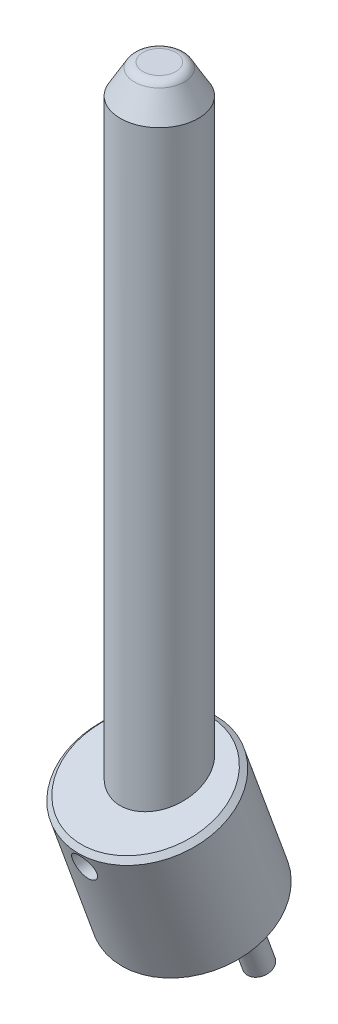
ISO-10303-21;
HEADER;
FILE_DESCRIPTION(('STEP AP214'),'2;1');
FILE_NAME('part.step','',(''),(''),'','','');
FILE_SCHEMA(('AUTOMOTIVE_DESIGN { 1 0 10303 214 1 1 1 1 }'));
ENDSEC;
DATA;
#1=APPLICATION_CONTEXT('core data for automotive mechanical design processes');
#2=APPLICATION_PROTOCOL_DEFINITION('international standard','automotive_design',2000,#1);
#3=PRODUCT_CONTEXT('',#1,'mechanical');
#4=PRODUCT('Part','Part','',(#3));
#5=PRODUCT_RELATED_PRODUCT_CATEGORY('part','',(#4));
#6=PRODUCT_DEFINITION_FORMATION('','',#4);
#7=PRODUCT_DEFINITION_CONTEXT('part definition',#1,'design');
#8=PRODUCT_DEFINITION('design','',#6,#7);
#9=PRODUCT_DEFINITION_SHAPE('','',#8);
#10=(LENGTH_UNIT() NAMED_UNIT(*) SI_UNIT(.MILLI.,.METRE.));
#11=(NAMED_UNIT(*) PLANE_ANGLE_UNIT() SI_UNIT($,.RADIAN.));
#12=(NAMED_UNIT(*) SI_UNIT($,.STERADIAN.) SOLID_ANGLE_UNIT());
#13=UNCERTAINTY_MEASURE_WITH_UNIT(LENGTH_MEASURE(1.E-05),#10,'distance_accuracy_value','');
#14=(GEOMETRIC_REPRESENTATION_CONTEXT(3) GLOBAL_UNCERTAINTY_ASSIGNED_CONTEXT((#13)) GLOBAL_UNIT_ASSIGNED_CONTEXT((#10,
#11,#12)) REPRESENTATION_CONTEXT('',''));
#15=CARTESIAN_POINT('',(0.,0.,0.));
#16=DIRECTION('',(0.,0.,1.));
#17=DIRECTION('',(1.,0.,0.));
#18=AXIS2_PLACEMENT_3D('',#15,#16,#17);
#19=CARTESIAN_POINT('',(0.,149.,0.));
#20=DIRECTION('',(0.,1.,0.));
#21=DIRECTION('',(-1.,0.,0.));
#22=AXIS2_PLACEMENT_3D('',#19,#20,#21);
#23=PLANE('',#22);
#24=CARTESIAN_POINT('',(0.,149.,-3.381197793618));
#25=CARTESIAN_POINT('',(0.0491775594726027,149.,-3.38119852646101));
#26=CARTESIAN_POINT('',(0.0983550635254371,149.,-3.3801249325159));
#27=CARTESIAN_POINT('',(0.19661648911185,149.,-3.37583435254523));
#28=CARTESIAN_POINT('',(0.245700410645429,149.,-3.37261736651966));
#29=CARTESIAN_POINT('',(0.343681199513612,149.,-3.36404526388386));
#30=CARTESIAN_POINT('',(0.392578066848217,149.,-3.35869014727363));
#31=CARTESIAN_POINT('',(0.490091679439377,149.,-3.34585220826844));
#32=CARTESIAN_POINT('',(0.538708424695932,149.,-3.33836938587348));
#33=CARTESIAN_POINT('',(0.635569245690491,149.,-3.32129021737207));
#34=CARTESIAN_POINT('',(0.683813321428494,149.,-3.31169387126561));
#35=CARTESIAN_POINT('',(0.779836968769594,149.,-3.29040593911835));
#36=CARTESIAN_POINT('',(0.827616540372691,149.,-3.27871435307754));
#37=CARTESIAN_POINT('',(0.922620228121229,149.,-3.25325819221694));
#38=CARTESIAN_POINT('',(0.969844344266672,149.,-3.23949361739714));
#39=CARTESIAN_POINT('',(1.0636472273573,149.,-3.20991768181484));
#40=CARTESIAN_POINT('',(1.11022599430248,149.,-3.19410632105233));
#41=CARTESIAN_POINT('',(1.20264951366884,149.,-3.16046691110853));
#42=CARTESIAN_POINT('',(1.24849426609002,149.,-3.14263886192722));
#43=CARTESIAN_POINT('',(1.33936248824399,149.,-3.10500001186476));
#44=CARTESIAN_POINT('',(1.38438595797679,149.,-3.08518921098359));
#45=CARTESIAN_POINT('',(1.47352591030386,149.,-3.04362256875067));
#46=CARTESIAN_POINT('',(1.51764239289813,149.,-3.02186672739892));
#47=CARTESIAN_POINT('',(1.60488439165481,149.,-2.97645141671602));
#48=CARTESIAN_POINT('',(1.64800990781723,149.,-2.95279194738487));
#49=CARTESIAN_POINT('',(1.73318788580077,149.,-2.90361442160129));
#50=CARTESIAN_POINT('',(1.7752403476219,149.,-2.87809636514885));
#51=CARTESIAN_POINT('',(1.85819215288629,149.,-2.82525022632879));
#52=CARTESIAN_POINT('',(1.89909149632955,149.,-2.79792214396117));
#53=CARTESIAN_POINT('',(1.97965926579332,149.,-2.74150802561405));
#54=CARTESIAN_POINT('',(2.01932769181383,149.,-2.71242198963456));
#55=CARTESIAN_POINT('',(2.09735790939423,148.999999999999,-2.65254713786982));
#56=CARTESIAN_POINT('',(2.13571970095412,148.999999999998,-2.62175832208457));
#57=CARTESIAN_POINT('',(2.21106439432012,149.000000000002,-2.55853723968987));
#58=CARTESIAN_POINT('',(2.24804729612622,149.000000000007,-2.52610497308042));
#59=CARTESIAN_POINT('',(2.32056094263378,148.999999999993,-2.45965603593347));
#60=CARTESIAN_POINT('',(2.35609168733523,148.999999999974,-2.42563936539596));
#61=CARTESIAN_POINT('',(2.42705213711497,149.000000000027,-2.35468855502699));
#62=CARTESIAN_POINT('',(2.46241950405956,149.000000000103,-2.3176920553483));
#63=CARTESIAN_POINT('',(2.53146011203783,148.999999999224,-2.24214947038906));
#64=CARTESIAN_POINT('',(2.56513331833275,148.999999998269,-2.20360335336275));
#65=CARTESIAN_POINT('',(2.63071590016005,148.99999999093,-2.12503640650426));
#66=CARTESIAN_POINT('',(2.66262520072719,148.999999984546,-2.08501551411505));
#67=CARTESIAN_POINT('',(2.72461562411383,148.999999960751,-2.00357584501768));
#68=CARTESIAN_POINT('',(2.75469662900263,148.999999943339,-1.96215697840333));
#69=CARTESIAN_POINT('',(2.79840512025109,148.999999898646,-1.89905244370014));
#70=CARTESIAN_POINT('',(2.81273996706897,148.999999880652,-1.87785353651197));
#71=CARTESIAN_POINT('',(2.84090934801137,148.999999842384,-1.83514783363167));
#72=CARTESIAN_POINT('',(2.85474423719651,148.999999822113,-1.81364127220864));
#73=CARTESIAN_POINT('',(2.89548728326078,148.999999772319,-1.74864244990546));
#74=CARTESIAN_POINT('',(2.92163476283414,148.999999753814,-1.70466969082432));
#75=CARTESIAN_POINT('',(2.97183520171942,148.999999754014,-1.6155484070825));
#76=CARTESIAN_POINT('',(2.99588817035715,148.99999977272,-1.57039988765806));
#77=CARTESIAN_POINT('',(3.04188859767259,148.999999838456,-1.47904330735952));
#78=CARTESIAN_POINT('',(3.06383619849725,148.999999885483,-1.43283531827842));
#79=CARTESIAN_POINT('',(3.10541271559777,148.999999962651,-1.33939702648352));
#80=CARTESIAN_POINT('',(3.12504193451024,148.999999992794,-1.29216685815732));
#81=CARTESIAN_POINT('',(3.15291976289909,149.000000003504,-1.22146858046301));
#82=CARTESIAN_POINT('',(3.16183489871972,149.000000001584,-1.19825675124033));
#83=CARTESIAN_POINT('',(3.1990199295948,148.999999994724,-1.09818755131));
#84=CARTESIAN_POINT('',(3.22479363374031,148.999999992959,-1.02037068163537));
#85=CARTESIAN_POINT('',(3.25883872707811,148.999999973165,-0.903503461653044));
#86=CARTESIAN_POINT('',(3.26930037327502,148.999999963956,-0.865070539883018));
#87=CARTESIAN_POINT('',(3.29035807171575,148.999999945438,-0.78187482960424));
#88=CARTESIAN_POINT('',(3.30072437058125,148.999999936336,-0.737052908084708));
#89=CARTESIAN_POINT('',(3.3142455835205,148.999999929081,-0.672514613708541));
#90=CARTESIAN_POINT('',(3.31816009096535,148.999999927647,-0.652953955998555));
#91=CARTESIAN_POINT('',(3.32632060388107,148.999999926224,-0.610180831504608));
#92=CARTESIAN_POINT('',(3.33049625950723,148.999999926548,-0.586954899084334));
#93=CARTESIAN_POINT('',(3.34228609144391,148.999999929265,-0.517153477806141));
#94=CARTESIAN_POINT('',(3.34916374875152,148.999999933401,-0.47045146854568));
#95=CARTESIAN_POINT('',(3.36093725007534,148.999999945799,-0.376800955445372));
#96=CARTESIAN_POINT('',(3.36583314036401,148.999999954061,-0.329852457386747));
#97=CARTESIAN_POINT('',(3.37363894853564,148.999999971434,-0.235792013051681));
#98=CARTESIAN_POINT('',(3.37654894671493,148.999999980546,-0.188680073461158));
#99=CARTESIAN_POINT('',(3.38036477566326,148.999999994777,-0.0943781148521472));
#100=CARTESIAN_POINT('',(3.38127072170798,148.999999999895,-0.0471881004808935));
#101=CARTESIAN_POINT('',(3.38112480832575,149.000000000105,0.0472251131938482));
#102=CARTESIAN_POINT('',(3.38007141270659,148.999999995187,0.0944483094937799));
#103=CARTESIAN_POINT('',(3.37605062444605,148.999999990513,0.188811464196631));
#104=CARTESIAN_POINT('',(3.37308328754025,148.999999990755,0.235951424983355));
#105=CARTESIAN_POINT('',(3.36523468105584,148.99999999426,0.330073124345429));
#106=CARTESIAN_POINT('',(3.36035337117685,148.999999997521,0.37705485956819));
#107=CARTESIAN_POINT('',(3.34865879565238,149.000000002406,0.470780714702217));
#108=CARTESIAN_POINT('',(3.34184539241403,149.000000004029,0.517524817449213));
#109=CARTESIAN_POINT('',(3.33026552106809,148.999999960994,0.587415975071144));
#110=CARTESIAN_POINT('',(3.32617861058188,148.999999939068,0.610677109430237));
#111=CARTESIAN_POINT('',(3.32001382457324,148.999999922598,0.64332853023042));
#112=CARTESIAN_POINT('',(3.31818160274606,148.999999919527,0.652765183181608));
#113=CARTESIAN_POINT('',(3.30790809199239,148.999999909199,0.70438704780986));
#114=CARTESIAN_POINT('',(3.29862776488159,148.999999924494,0.746407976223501));
#115=CARTESIAN_POINT('',(3.27611885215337,148.999999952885,0.839847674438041));
#116=CARTESIAN_POINT('',(3.26247449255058,148.999999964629,0.89116555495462));
#117=CARTESIAN_POINT('',(3.22698341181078,148.999999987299,1.01297067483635));
#118=CARTESIAN_POINT('',(3.20401223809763,148.999999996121,1.08313569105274));
#119=CARTESIAN_POINT('',(3.16757439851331,149.00000000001,1.18334600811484));
#120=CARTESIAN_POINT('',(3.15590282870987,148.999999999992,1.21405838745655));
#121=CARTESIAN_POINT('',(3.12494638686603,149.000000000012,1.29216796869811));
#122=CARTESIAN_POINT('',(3.10504412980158,149.000000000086,1.33932319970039));
#123=CARTESIAN_POINT('',(3.06313614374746,148.999999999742,1.43268851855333));
#124=CARTESIAN_POINT('',(3.04113038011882,148.999999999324,1.4788985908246));
#125=CARTESIAN_POINT('',(2.99507134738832,148.999999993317,1.57028914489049));
#126=CARTESIAN_POINT('',(2.97101799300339,148.999999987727,1.61546958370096));
#127=CARTESIAN_POINT('',(2.92090425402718,148.99999996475,1.70470923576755));
#128=CARTESIAN_POINT('',(2.89484373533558,148.999999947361,1.74876837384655));
#129=CARTESIAN_POINT('',(2.85429856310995,148.9999999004,1.81395013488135));
#130=CARTESIAN_POINT('',(2.84054017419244,148.999999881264,1.83552759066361));
#131=CARTESIAN_POINT('',(2.81254197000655,148.999999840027,1.87834577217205));
#132=CARTESIAN_POINT('',(2.79830250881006,148.999999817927,1.89958672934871));
#133=CARTESIAN_POINT('',(2.75484041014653,148.999999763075,1.96280026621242));
#134=CARTESIAN_POINT('',(2.72487327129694,148.999999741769,2.00426477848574));
#135=CARTESIAN_POINT('',(2.66302492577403,148.999999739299,2.08573639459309));
#136=CARTESIAN_POINT('',(2.63114372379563,148.999999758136,2.12574350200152));
#137=CARTESIAN_POINT('',(2.56557045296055,148.999999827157,2.20424439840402));
#138=CARTESIAN_POINT('',(2.5318785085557,148.99999987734,2.24273829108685));
#139=CARTESIAN_POINT('',(2.46263073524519,148.999999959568,2.31799882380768));
#140=CARTESIAN_POINT('',(2.42707515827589,148.999999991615,2.35476569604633));
#141=CARTESIAN_POINT('',(2.37140677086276,149.000000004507,2.41027252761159));
#142=CARTESIAN_POINT('',(2.35175738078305,149.000000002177,2.42948514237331));
#143=CARTESIAN_POINT('',(2.26802085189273,148.999999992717,2.50941121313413));
#144=CARTESIAN_POINT('',(2.20177871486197,148.999999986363,2.56792039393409));
#145=CARTESIAN_POINT('',(2.10003781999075,148.999999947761,2.65091291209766));
#146=CARTESIAN_POINT('',(2.06619123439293,148.999999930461,2.67746023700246));
#147=CARTESIAN_POINT('',(1.99205588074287,148.999999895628,2.73332764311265));
#148=CARTESIAN_POINT('',(1.95159524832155,148.999999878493,2.76242170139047));
#149=CARTESIAN_POINT('',(1.89261855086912,148.99999986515,2.80284358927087));
#150=CARTESIAN_POINT('',(1.87461412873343,148.999999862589,2.81492542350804));
#151=CARTESIAN_POINT('',(1.83512217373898,148.99999986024,2.84086885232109));
#152=CARTESIAN_POINT('',(1.813589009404,148.999999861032,2.85466108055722));
#153=CARTESIAN_POINT('',(1.74852510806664,148.999999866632,2.89529179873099));
#154=CARTESIAN_POINT('',(1.70452676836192,148.999999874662,2.921386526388));
#155=CARTESIAN_POINT('',(1.61538182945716,148.999999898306,2.97152713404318));
#156=CARTESIAN_POINT('',(1.57023526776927,148.999999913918,2.9955730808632));
#157=CARTESIAN_POINT('',(1.47889045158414,148.999999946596,3.04157160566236));
#158=CARTESIAN_POINT('',(1.43269225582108,148.99999996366,3.06352430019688));
#159=CARTESIAN_POINT('',(1.33933610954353,148.99999999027,3.10527343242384));
#160=CARTESIAN_POINT('',(1.29217823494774,148.999999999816,3.12507003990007));
#161=CARTESIAN_POINT('',(1.20065831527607,149.00000000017,3.16109558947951));
#162=CARTESIAN_POINT('',(1.15635789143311,148.999999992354,3.17748154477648));
#163=CARTESIAN_POINT('',(1.06713504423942,148.999999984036,3.20845589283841));
#164=CARTESIAN_POINT('',(1.02221264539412,148.999999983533,3.22304435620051));
#165=CARTESIAN_POINT('',(0.931813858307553,148.999999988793,3.25039463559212));
#166=CARTESIAN_POINT('',(0.886337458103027,148.999999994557,3.26315641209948));
#167=CARTESIAN_POINT('',(0.79489519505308,149.000000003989,3.28680491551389));
#168=CARTESIAN_POINT('',(0.748929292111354,149.000000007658,3.29769148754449));
#169=CARTESIAN_POINT('',(0.686121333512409,148.999999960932,3.31129818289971));
#170=CARTESIAN_POINT('',(0.6694438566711,148.999999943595,3.31479031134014));
#171=CARTESIAN_POINT('',(0.639370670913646,148.999999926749,3.32077891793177));
#172=CARTESIAN_POINT('',(0.625986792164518,148.999999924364,3.32333471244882));
#173=CARTESIAN_POINT('',(0.564781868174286,148.999999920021,3.33461824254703));
#174=CARTESIAN_POINT('',(0.516772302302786,148.999999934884,3.34234416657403));
#175=CARTESIAN_POINT('',(0.428809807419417,148.999999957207,3.35455837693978));
#176=CARTESIAN_POINT('',(0.388901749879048,148.999999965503,3.35937566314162));
#177=CARTESIAN_POINT('',(0.315880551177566,148.999999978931,3.36686744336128));
#178=CARTESIAN_POINT('',(0.282790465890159,148.999999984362,3.3697687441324));
#179=CARTESIAN_POINT('',(0.198641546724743,148.999999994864,3.37590122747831));
#180=CARTESIAN_POINT('',(0.147531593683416,148.999999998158,3.3784640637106));
#181=CARTESIAN_POINT('',(0.0775593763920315,148.999999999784,3.38039422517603));
#182=CARTESIAN_POINT('',(0.0587195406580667,148.999999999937,3.38075747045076));
#183=CARTESIAN_POINT('',(0.0265859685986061,149.000000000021,3.38112029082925));
#184=CARTESIAN_POINT('',(0.0132930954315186,149.000000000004,3.38119546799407));
#185=CARTESIAN_POINT('',(0.,149.,3.381197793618));
#186=B_SPLINE_CURVE_WITH_KNOTS('',3,(#24,#25,#26,#27,#28,#29,#30,#31,#32,#33,#34,#35,#36,#37,
#38,#39,#40,#41,#42,#43,#44,#45,#46,#47,#48,#49,#50,#51,#52,#53,#54,#55,#56,#57,#58,#59,#60,#61,
#62,#63,#64,#65,#66,#67,#68,#69,#70,#71,#72,#73,#74,#75,#76,#77,#78,#79,#80,#81,#82,#83,#84,#85,
#86,#87,#88,#89,#90,#91,#92,#93,#94,#95,#96,#97,#98,#99,#100,#101,#102,#103,#104,#105,#106,#107,
#108,#109,#110,#111,#112,#113,#114,#115,#116,#117,#118,#119,#120,#121,#122,#123,#124,#125,#126,
#127,#128,#129,#130,#131,#132,#133,#134,#135,#136,#137,#138,#139,#140,#141,#142,#143,#144,#145,
#146,#147,#148,#149,#150,#151,#152,#153,#154,#155,#156,#157,#158,#159,#160,#161,#162,#163,#164,
#165,#166,#167,#168,#169,#170,#171,#172,#173,#174,#175,#176,#177,#178,#179,#180,#181,#182,#183,
#184,#185),.UNSPECIFIED.,.F.,.F.,(4,2,2,2,2,2,2,2,2,2,2,2,2,2,2,2,2,2,2,2,2,2,2,2,2,2,2,2,2,2,2,
2,2,2,2,2,2,2,2,2,2,2,2,2,2,2,2,2,2,2,2,2,2,2,2,2,2,2,2,2,2,2,2,2,2,2,2,2,2,2,2,2,2,2,2,2,2,2,2,
2,4),(0.,0.147520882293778,0.295041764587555,0.44256264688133,0.590083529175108,
0.737604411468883,0.88512529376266,1.03264617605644,1.18016705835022,1.32768794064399,
1.47520882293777,1.62272970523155,1.77025058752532,1.9177714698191,2.06529235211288,
2.21281323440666,2.36033411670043,2.50785499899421,2.65537588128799,2.8088697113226,
2.96236668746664,3.11587018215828,3.26938356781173,3.34614986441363,3.42286052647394,
3.57627688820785,3.72969256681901,3.88309788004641,4.03648314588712,4.11107818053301,
4.3567273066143,4.47620511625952,4.61417295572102,4.67401611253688,4.74480627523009,
4.88637772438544,5.02794586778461,5.16950828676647,5.31106256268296,5.45272786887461,
5.59438904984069,5.73605321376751,5.87772746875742,5.94857427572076,5.97741258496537,
6.10647459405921,6.26572562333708,6.48702971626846,6.58558753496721,6.73908100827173,
6.89257700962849,7.04607940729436,7.19959206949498,7.27635828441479,7.35306917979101,
7.50648650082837,7.65990344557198,7.81330985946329,7.9666955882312,8.0491391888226,
8.31394403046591,8.44297054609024,8.59241517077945,8.65745956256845,8.73416806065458,
8.88757342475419,9.04097378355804,9.19436559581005,9.34774532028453,9.48940808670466,
9.63106528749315,9.77272555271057,9.91439751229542,9.96551300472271,10.0063890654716,
10.1522163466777,10.2727850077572,10.3724238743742,10.5258841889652,10.5824125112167,
10.6222911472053),.UNSPECIFIED.);
#187=CARTESIAN_POINT('',(0.,149.,-3.3811977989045));
#188=VERTEX_POINT('',#187);
#189=CARTESIAN_POINT('',(0.,149.,3.3811977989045));
#190=VERTEX_POINT('',#189);
#191=EDGE_CURVE('P0_E38',#188,#190,#186,.T.);
#192=ORIENTED_EDGE('',*,*,#191,.F.);
#193=CARTESIAN_POINT('',(0.,149.,0.));
#194=DIRECTION('',(0.,-1.,0.));
#195=DIRECTION('',(0.,0.,1.));
#196=AXIS2_PLACEMENT_3D('',#193,#194,#195);
#197=CIRCLE('',#196,3.381197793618);
#198=EDGE_CURVE('P0_E42',#190,#188,#197,.T.);
#199=ORIENTED_EDGE('',*,*,#198,.F.);
#200=EDGE_LOOP('',(#192,#199));
#201=FACE_BOUND('',#200,.T.);
#202=ADVANCED_FACE('P0_F17',(#201),#23,.T.);
#203=CARTESIAN_POINT('',(0.,147.,0.));
#204=DIRECTION('',(0.,1.,0.));
#205=DIRECTION('',(0.0117940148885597,0.,0.999930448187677));
#206=AXIS2_PLACEMENT_3D('',#203,#204,#205);
#207=TOROIDAL_SURFACE('',#206,3.381197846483,2.);
#208=ORIENTED_EDGE('',*,*,#191,.T.);
#209=ORIENTED_EDGE('',*,*,#198,.T.);
#210=EDGE_LOOP('',(#208,#209));
#211=FACE_BOUND('',#210,.T.);
#212=CARTESIAN_POINT('',(0.,148.000000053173,0.));
#213=DIRECTION('',(0.,-1.,0.));
#214=DIRECTION('',(0.,0.,1.));
#215=AXIS2_PLACEMENT_3D('',#212,#213,#214);
#216=CIRCLE('',#215,5.11324862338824);
#217=CARTESIAN_POINT('',(0.,148.000000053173,5.11324862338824));
#218=VERTEX_POINT('',#217);
#219=EDGE_CURVE('P0_E48',#218,#218,#216,.T.);
#220=ORIENTED_EDGE('',*,*,#219,.F.);
#221=EDGE_LOOP('',(#220));
#222=FACE_BOUND('',#221,.T.);
#223=ADVANCED_FACE('P0_F40',(#211,#222),#207,.T.);
#224=CARTESIAN_POINT('',(0.,0.,0.));
#225=DIRECTION('',(0.,1.,0.));
#226=DIRECTION('',(-1.,0.,0.));
#227=AXIS2_PLACEMENT_3D('',#224,#225,#226);
#228=PLANE('',#227);
#229=CARTESIAN_POINT('',(0.,9.20802746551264E-07,0.));
#230=DIRECTION('',(0.,1.,0.));
#231=DIRECTION('',(-1.,0.,0.));
#232=AXIS2_PLACEMENT_3D('',#229,#230,#231);
#233=CIRCLE('',#232,6.99999849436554);
#234=CARTESIAN_POINT('',(-6.99999849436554,9.20802746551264E-07,0.));
#235=VERTEX_POINT('',#234);
#236=EDGE_CURVE('P0_E85',#235,#235,#233,.T.);
#237=ORIENTED_EDGE('',*,*,#236,.F.);
#238=EDGE_LOOP('',(#237));
#239=FACE_BOUND('',#238,.T.);
#240=ADVANCED_FACE('P0_F76',(#239),#228,.F.);
#241=CARTESIAN_POINT('',(0.,14.,2.94337567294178));
#242=DIRECTION('',(0.,0.,1.));
#243=DIRECTION('',(0.,-1.,0.));
#244=AXIS2_PLACEMENT_3D('',#241,#242,#243);
#245=CONICAL_SURFACE('',#244,2.50000000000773,1.04719755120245);
#246=CARTESIAN_POINT('',(0.,14.0000000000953,1.49999999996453));
#247=VERTEX_POINT('',#246);
#248=VERTEX_LOOP('',#247);
#249=FACE_BOUND('',#248,.T.);
#250=CARTESIAN_POINT('',(0.,14.,2.943375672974));
#251=DIRECTION('',(0.,0.,1.));
#252=DIRECTION('',(0.,-1.,0.));
#253=AXIS2_PLACEMENT_3D('',#250,#251,#252);
#254=CIRCLE('',#253,2.5);
#255=CARTESIAN_POINT('',(0.,11.5,2.943375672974));
#256=VERTEX_POINT('',#255);
#257=EDGE_CURVE('P0_E82',#256,#256,#254,.T.);
#258=ORIENTED_EDGE('',*,*,#257,.T.);
#259=EDGE_LOOP('',(#258));
#260=FACE_BOUND('',#259,.T.);
#261=ADVANCED_FACE('P0_F116',(#249,#260),#245,.F.);
#262=CARTESIAN_POINT('',(0.,143.0000000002,0.));
#263=DIRECTION('',(0.,-1.,0.));
#264=DIRECTION('',(1.,0.,0.));
#265=AXIS2_PLACEMENT_3D('',#262,#263,#264);
#266=CONICAL_SURFACE('',#265,7.99999999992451,0.52359877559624);
#267=CARTESIAN_POINT('',(0.,143.,0.));
#268=DIRECTION('',(0.,1.,0.));
#269=DIRECTION('',(-1.,0.,0.));
#270=AXIS2_PLACEMENT_3D('',#267,#268,#269);
#271=CIRCLE('',#270,8.);
#272=CARTESIAN_POINT('',(-8.,143.,0.));
#273=VERTEX_POINT('',#272);
#274=EDGE_CURVE('P0_E92',#273,#273,#271,.F.);
#275=ORIENTED_EDGE('',*,*,#274,.F.);
#276=EDGE_LOOP('',(#275));
#277=FACE_BOUND('',#276,.T.);
#278=ORIENTED_EDGE('',*,*,#219,.T.);
#279=EDGE_LOOP('',(#278));
#280=FACE_BOUND('',#279,.T.);
#281=ADVANCED_FACE('P0_F108',(#277,#280),#266,.T.);
#282=CARTESIAN_POINT('',(0.,1.00000172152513,0.));
#283=DIRECTION('',(0.,1.,0.));
#284=DIRECTION('',(-1.,0.,0.));
#285=AXIS2_PLACEMENT_3D('',#282,#283,#284);
#286=CONICAL_SURFACE('',#285,7.9999989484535,0.785397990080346);
#287=CARTESIAN_POINT('',(0.,1.000000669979,0.));
#288=DIRECTION('',(0.,1.,0.));
#289=DIRECTION('',(-1.,0.,0.));
#290=AXIS2_PLACEMENT_3D('',#287,#288,#289);
#291=CIRCLE('',#290,8.);
#292=CARTESIAN_POINT('',(-8.,1.000000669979,0.));
#293=VERTEX_POINT('',#292);
#294=EDGE_CURVE('P0_E28',#293,#293,#291,.T.);
#295=ORIENTED_EDGE('',*,*,#294,.F.);
#296=EDGE_LOOP('',(#295));
#297=FACE_BOUND('',#296,.T.);
#298=ORIENTED_EDGE('',*,*,#236,.T.);
#299=EDGE_LOOP('',(#298));
#300=FACE_BOUND('',#299,.T.);
#301=ADVANCED_FACE('P0_F105',(#297,#300),#286,.T.);
#302=CARTESIAN_POINT('',(0.,14.,1.075));
#303=DIRECTION('',(0.,0.,1.));
#304=DIRECTION('',(0.,-1.,0.));
#305=AXIS2_PLACEMENT_3D('',#302,#303,#304);
#306=CYLINDRICAL_SURFACE('',#305,2.5);
#307=ORIENTED_EDGE('',*,*,#257,.F.);
#308=EDGE_LOOP('',(#307));
#309=FACE_BOUND('',#308,.T.);
#310=CARTESIAN_POINT('',(0.,11.5,8.));
#311=CARTESIAN_POINT('',(-0.136696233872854,11.5000075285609,7.99999486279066));
#312=CARTESIAN_POINT('',(-0.273538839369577,11.5112631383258,7.99645812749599));
#313=CARTESIAN_POINT('',(-0.543359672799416,11.5559205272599,7.98267442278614));
#314=CARTESIAN_POINT('',(-0.676330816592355,11.589360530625,7.97241587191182));
#315=CARTESIAN_POINT('',(-0.934271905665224,11.6771461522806,7.94631394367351));
#316=CARTESIAN_POINT('',(-1.05925832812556,11.7314469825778,7.93048253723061));
#317=CARTESIAN_POINT('',(-1.2983071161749,11.8592577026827,7.89487323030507));
#318=CARTESIAN_POINT('',(-1.4123711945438,11.9327645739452,7.87509595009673));
#319=CARTESIAN_POINT('',(-1.62992724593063,12.0993097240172,7.83300483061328));
#320=CARTESIAN_POINT('',(-1.73303436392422,12.1928367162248,7.81063552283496));
#321=CARTESIAN_POINT('',(-1.92239021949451,12.3957308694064,7.76620212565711));
#322=CARTESIAN_POINT('',(-2.00863490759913,12.5051018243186,7.74413811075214));
#323=CARTESIAN_POINT('',(-2.16388692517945,12.7398894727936,7.70222283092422));
#324=CARTESIAN_POINT('',(-2.23241606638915,12.8656356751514,7.6824396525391));
#325=CARTESIAN_POINT('',(-2.34719509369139,13.1275854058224,7.64815595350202));
#326=CARTESIAN_POINT('',(-2.3934509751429,13.2637861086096,7.6336540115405));
#327=CARTESIAN_POINT('',(-2.4609691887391,13.5384561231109,7.61215214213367));
#328=CARTESIAN_POINT('',(-2.48294218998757,13.6767336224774,7.60493946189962));
#329=CARTESIAN_POINT('',(-2.50349110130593,13.9551861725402,7.59820110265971));
#330=CARTESIAN_POINT('',(-2.50207322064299,14.0953607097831,7.59867338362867));
#331=CARTESIAN_POINT('',(-2.47643652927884,14.3677485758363,7.60706377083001));
#332=CARTESIAN_POINT('',(-2.45312128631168,14.5000575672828,7.61468679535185));
#333=CARTESIAN_POINT('',(-2.38581648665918,14.7587836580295,7.63604044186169));
#334=CARTESIAN_POINT('',(-2.34182462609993,14.8852000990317,7.64977174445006));
#335=CARTESIAN_POINT('',(-2.23377596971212,15.1307074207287,7.68202134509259));
#336=CARTESIAN_POINT('',(-2.16943495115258,15.2496640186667,7.7006067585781));
#337=CARTESIAN_POINT('',(-2.02271557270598,15.4753816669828,7.74043834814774));
#338=CARTESIAN_POINT('',(-1.94033355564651,15.5821402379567,7.76168506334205));
#339=CARTESIAN_POINT('',(-1.75545127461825,15.7855312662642,7.80562654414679));
#340=CARTESIAN_POINT('',(-1.65220788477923,15.8814846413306,7.82834327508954));
#341=CARTESIAN_POINT('',(-1.43076939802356,16.0549161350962,7.87182395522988));
#342=CARTESIAN_POINT('',(-1.31256787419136,16.1323862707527,7.8925870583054));
#343=CARTESIAN_POINT('',(-1.06322528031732,16.2671146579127,7.93004255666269));
#344=CARTESIAN_POINT('',(-0.931982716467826,16.3241954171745,7.94669883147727));
#345=CARTESIAN_POINT('',(-0.661263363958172,16.4151681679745,7.97377752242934));
#346=CARTESIAN_POINT('',(-0.521804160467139,16.4491078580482,7.98421275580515));
#347=CARTESIAN_POINT('',(-0.317572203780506,16.4805676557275,7.9939447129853));
#348=CARTESIAN_POINT('',(-0.25430866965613,16.4878463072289,7.99620897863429));
#349=CARTESIAN_POINT('',(-0.127374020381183,16.4975642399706,7.99923782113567));
#350=CARTESIAN_POINT('',(-0.0637029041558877,16.5000035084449,8.000002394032));
#351=CARTESIAN_POINT('',(0.13669623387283,16.4999924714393,7.99999486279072));
#352=CARTESIAN_POINT('',(0.273538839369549,16.4887368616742,7.996458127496));
#353=CARTESIAN_POINT('',(0.543359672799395,16.4440794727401,7.98267442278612));
#354=CARTESIAN_POINT('',(0.676330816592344,16.410639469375,7.97241587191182));
#355=CARTESIAN_POINT('',(0.934271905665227,16.3228538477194,7.94631394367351));
#356=CARTESIAN_POINT('',(1.05925832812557,16.2685530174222,7.93048253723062));
#357=CARTESIAN_POINT('',(1.2983071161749,16.1407422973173,7.89487323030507));
#358=CARTESIAN_POINT('',(1.4123711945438,16.0672354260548,7.87509595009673));
#359=CARTESIAN_POINT('',(1.62992724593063,15.9006902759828,7.83300483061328));
#360=CARTESIAN_POINT('',(1.73303436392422,15.8071632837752,7.81063552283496));
#361=CARTESIAN_POINT('',(1.92239021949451,15.6042691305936,7.76620212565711));
#362=CARTESIAN_POINT('',(2.00863490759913,15.4948981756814,7.74413811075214));
#363=CARTESIAN_POINT('',(2.16388692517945,15.2601105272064,7.70222283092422));
#364=CARTESIAN_POINT('',(2.23241606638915,15.1343643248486,7.6824396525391));
#365=CARTESIAN_POINT('',(2.34719509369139,14.8724145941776,7.64815595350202));
#366=CARTESIAN_POINT('',(2.3934509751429,14.7362138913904,7.6336540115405));
#367=CARTESIAN_POINT('',(2.4609691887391,14.4615438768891,7.61215214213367));
#368=CARTESIAN_POINT('',(2.48294218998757,14.3232663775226,7.60493946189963));
#369=CARTESIAN_POINT('',(2.50349110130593,14.0448138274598,7.59820110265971));
#370=CARTESIAN_POINT('',(2.50207322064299,13.9046392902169,7.59867338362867));
#371=CARTESIAN_POINT('',(2.47643652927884,13.6322514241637,7.60706377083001));
#372=CARTESIAN_POINT('',(2.45312128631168,13.4999424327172,7.61468679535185));
#373=CARTESIAN_POINT('',(2.38581648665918,13.2412163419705,7.63604044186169));
#374=CARTESIAN_POINT('',(2.34182462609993,13.1147999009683,7.64977174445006));
#375=CARTESIAN_POINT('',(2.23377596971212,12.8692925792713,7.68202134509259));
#376=CARTESIAN_POINT('',(2.16943495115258,12.7503359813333,7.7006067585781));
#377=CARTESIAN_POINT('',(2.02271557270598,12.5246183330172,7.74043834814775));
#378=CARTESIAN_POINT('',(1.94033355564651,12.4178597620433,7.76168506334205));
#379=CARTESIAN_POINT('',(1.75545127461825,12.2144687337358,7.80562654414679));
#380=CARTESIAN_POINT('',(1.65220788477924,12.1185153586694,7.82834327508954));
#381=CARTESIAN_POINT('',(1.43076939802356,11.9450838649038,7.87182395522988));
#382=CARTESIAN_POINT('',(1.31256787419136,11.8676137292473,7.8925870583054));
#383=CARTESIAN_POINT('',(1.06322528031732,11.7328853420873,7.93004255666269));
#384=CARTESIAN_POINT('',(0.931982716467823,11.6758045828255,7.94669883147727));
#385=CARTESIAN_POINT('',(0.661263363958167,11.5848318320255,7.97377752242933));
#386=CARTESIAN_POINT('',(0.521804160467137,11.5508921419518,7.98421275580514));
#387=CARTESIAN_POINT('',(0.317572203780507,11.5194323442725,7.9939447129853));
#388=CARTESIAN_POINT('',(0.254308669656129,11.512153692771,7.9962089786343));
#389=CARTESIAN_POINT('',(0.127374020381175,11.5024357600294,7.99923782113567));
#390=CARTESIAN_POINT('',(0.0637029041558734,11.4999964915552,8.00000239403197));
#391=CARTESIAN_POINT('',(0.,11.5,8.));
#392=B_SPLINE_CURVE_WITH_KNOTS('',3,(#310,#311,#312,#313,#314,#315,#316,#317,#318,#319,#320,
#321,#322,#323,#324,#325,#326,#327,#328,#329,#330,#331,#332,#333,#334,#335,#336,#337,#338,#339,
#340,#341,#342,#343,#344,#345,#346,#347,#348,#349,#350,#351,#352,#353,#354,#355,#356,#357,#358,
#359,#360,#361,#362,#363,#364,#365,#366,#367,#368,#369,#370,#371,#372,#373,#374,#375,#376,#377,
#378,#379,#380,#381,#382,#383,#384,#385,#386,#387,#388,#389,#390,#391),.UNSPECIFIED.,.T.,.F.,(4,
2,2,2,2,2,2,2,2,2,2,2,2,2,2,2,2,2,2,2,2,2,2,2,2,2,2,2,2,2,2,2,2,2,2,2,2,2,2,2,4),(0.,
0.409843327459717,0.820394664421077,1.23006943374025,1.6396798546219,2.06074511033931,
2.48191136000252,2.91347666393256,3.34492573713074,3.76338291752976,4.18172901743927,
4.58353732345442,4.98539041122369,5.39312450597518,5.80094133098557,6.22725884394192,
6.65376015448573,7.08388858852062,7.51312773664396,7.70412159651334,7.89511596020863,
8.30495928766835,8.71551062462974,9.12518539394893,9.53479581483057,9.95586107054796,
10.3770273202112,10.8085926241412,11.2400416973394,11.6584988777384,12.0768449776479,
12.4786532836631,12.8805063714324,13.2882404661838,13.6960572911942,14.1223748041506,
14.5488761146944,14.9790045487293,15.4082436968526,15.599237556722,15.7902319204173),.UNSPECIFIED.);
#393=CARTESIAN_POINT('',(0.,11.5,8.));
#394=VERTEX_POINT('',#393);
#395=EDGE_CURVE('P0_E11',#394,#394,#392,.T.);
#396=ORIENTED_EDGE('',*,*,#395,.F.);
#397=EDGE_LOOP('',(#396));
#398=FACE_BOUND('',#397,.T.);
#399=ADVANCED_FACE('P0_F107',(#309,#398),#306,.F.);
#400=CARTESIAN_POINT('',(0.,-7.45,0.));
#401=DIRECTION('',(0.,1.,0.));
#402=DIRECTION('',(-1.,0.,0.));
#403=AXIS2_PLACEMENT_3D('',#400,#401,#402);
#404=CYLINDRICAL_SURFACE('',#403,8.);
#405=ORIENTED_EDGE('',*,*,#274,.T.);
#406=EDGE_LOOP('',(#405));
#407=FACE_BOUND('',#406,.T.);
#408=ORIENTED_EDGE('',*,*,#294,.T.);
#409=EDGE_LOOP('',(#408));
#410=FACE_BOUND('',#409,.T.);
#411=ORIENTED_EDGE('',*,*,#395,.T.);
#412=EDGE_LOOP('',(#411));
#413=FACE_BOUND('',#412,.T.);
#414=ADVANCED_FACE('P0_F102',(#407,#410,#413),#404,.T.);
#415=CLOSED_SHELL('',(#202,#223,#240,#261,#281,#301,#399,#414));
#416=MANIFOLD_SOLID_BREP('P0_B1',#415);
#417=CARTESIAN_POINT('',(0.,-10.3851484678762,-9.32263722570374));
#418=DIRECTION('',(0.,-0.939692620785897,-0.342020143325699));
#419=DIRECTION('',(0.,0.342020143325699,-0.939692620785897));
#420=AXIS2_PLACEMENT_3D('',#417,#418,#419);
#421=PLANE('',#420);
#422=CARTESIAN_POINT('',(-11.25,-10.3851484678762,-9.32263722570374));
#423=DIRECTION('',(0.,-0.939692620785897,-0.342020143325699));
#424=DIRECTION('',(0.,0.342020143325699,-0.939692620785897));
#425=AXIS2_PLACEMENT_3D('',#422,#423,#424);
#426=CIRCLE('',#425,1.9999654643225);
#427=CARTESIAN_POINT('',(-11.25,-9.7011199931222,-11.2019900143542));
#428=VERTEX_POINT('',#427);
#429=EDGE_CURVE('P1_E17',#428,#428,#426,.F.);
#430=ORIENTED_EDGE('',*,*,#429,.F.);
#431=EDGE_LOOP('',(#430));
#432=FACE_BOUND('',#431,.T.);
#433=ADVANCED_FACE('P1_F14',(#432),#421,.T.);
#434=CARTESIAN_POINT('',(0.,-10.3851484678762,-9.32263722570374));
#435=DIRECTION('',(0.,-0.939692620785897,-0.342020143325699));
#436=DIRECTION('',(0.,0.342020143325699,-0.939692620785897));
#437=AXIS2_PLACEMENT_3D('',#434,#435,#436);
#438=PLANE('',#437);
#439=CARTESIAN_POINT('',(11.25,-10.3851484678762,-9.32263722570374));
#440=DIRECTION('',(0.,-0.939692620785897,-0.342020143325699));
#441=DIRECTION('',(0.,0.342020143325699,-0.939692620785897));
#442=AXIS2_PLACEMENT_3D('',#439,#440,#441);
#443=CIRCLE('',#442,1.99996546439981);
#444=CARTESIAN_POINT('',(11.25,-9.70111999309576,-11.2019900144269));
#445=VERTEX_POINT('',#444);
#446=EDGE_CURVE('P1_E114',#445,#445,#443,.F.);
#447=ORIENTED_EDGE('',*,*,#446,.F.);
#448=EDGE_LOOP('',(#447));
#449=FACE_BOUND('',#448,.T.);
#450=ADVANCED_FACE('P1_F104',(#449),#438,.T.);
#451=CARTESIAN_POINT('',(0.,0.,0.));
#452=DIRECTION('',(0.,-1.,0.));
#453=DIRECTION('',(0.,0.,-1.));
#454=AXIS2_PLACEMENT_3D('',#451,#452,#453);
#455=PLANE('',#454);
#456=CARTESIAN_POINT('',(0.,5.27789617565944E-13,2.55611504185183E-12));
#457=DIRECTION('',(0.,-1.,0.));
#458=DIRECTION('',(0.,0.,-1.));
#459=AXIS2_PLACEMENT_3D('',#456,#457,#458);
#460=CIRCLE('',#459,8.);
#461=CARTESIAN_POINT('',(0.,5.27789617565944E-13,-7.99999999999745));
#462=VERTEX_POINT('',#461);
#463=EDGE_CURVE('P1_E116',#462,#462,#460,.F.);
#464=ORIENTED_EDGE('',*,*,#463,.T.);
#465=EDGE_LOOP('',(#464));
#466=FACE_BOUND('',#465,.T.);
#467=ADVANCED_FACE('P1_F101',(#466),#455,.F.);
#468=CARTESIAN_POINT('',(-11.25,-9.9152792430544,-9.15161881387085));
#469=DIRECTION('',(0.,0.939692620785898,0.342020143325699));
#470=DIRECTION('',(0.,-0.342020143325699,0.939692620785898));
#471=AXIS2_PLACEMENT_3D('',#468,#469,#470);
#472=CONICAL_SURFACE('',#471,2.49998121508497,0.78538952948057);
#473=CARTESIAN_POINT('',(-11.25,-9.91526159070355,-9.15161238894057));
#474=DIRECTION('',(0.,0.939692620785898,0.342020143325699));
#475=DIRECTION('',(0.,-0.342020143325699,0.939692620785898));
#476=AXIS2_PLACEMENT_3D('',#473,#474,#475);
#477=CIRCLE('',#476,2.5);
#478=CARTESIAN_POINT('',(-11.25,-10.7703119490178,-6.80238083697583));
#479=VERTEX_POINT('',#478);
#480=EDGE_CURVE('P1_E118',#479,#479,#477,.T.);
#481=ORIENTED_EDGE('',*,*,#480,.F.);
#482=EDGE_LOOP('',(#481));
#483=FACE_BOUND('',#482,.T.);
#484=ORIENTED_EDGE('',*,*,#429,.T.);
#485=EDGE_LOOP('',(#484));
#486=FACE_BOUND('',#485,.T.);
#487=ADVANCED_FACE('P1_F97',(#483,#486),#472,.T.);
#488=CARTESIAN_POINT('',(11.25,-9.9152792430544,-9.15161881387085));
#489=DIRECTION('',(0.,0.939692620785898,0.342020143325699));
#490=DIRECTION('',(0.,-0.342020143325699,0.939692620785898));
#491=AXIS2_PLACEMENT_3D('',#488,#489,#490);
#492=CONICAL_SURFACE('',#491,2.49998121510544,0.785389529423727);
#493=CARTESIAN_POINT('',(11.25,-9.91526159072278,-9.15161238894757));
#494=DIRECTION('',(0.,0.939692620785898,0.342020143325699));
#495=DIRECTION('',(0.,-0.342020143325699,0.939692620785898));
#496=AXIS2_PLACEMENT_3D('',#493,#494,#495);
#497=CIRCLE('',#496,2.5);
#498=CARTESIAN_POINT('',(11.25,-10.770311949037,-6.80238083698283));
#499=VERTEX_POINT('',#498);
#500=EDGE_CURVE('P1_E123',#499,#499,#497,.T.);
#501=ORIENTED_EDGE('',*,*,#500,.F.);
#502=EDGE_LOOP('',(#501));
#503=FACE_BOUND('',#502,.T.);
#504=ORIENTED_EDGE('',*,*,#446,.T.);
#505=EDGE_LOOP('',(#504));
#506=FACE_BOUND('',#505,.T.);
#507=ADVANCED_FACE('P1_F92',(#503,#506),#492,.T.);
#508=CARTESIAN_POINT('',(0.,38.5282654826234,2.55524768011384E-12));
#509=DIRECTION('',(0.,-1.,0.));
#510=DIRECTION('',(0.,0.,-1.));
#511=AXIS2_PLACEMENT_3D('',#508,#509,#510);
#512=CYLINDRICAL_SURFACE('',#511,8.);
#513=CARTESIAN_POINT('',(0.,23.9999999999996,2.55438031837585E-12));
#514=DIRECTION('',(0.,0.939692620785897,0.342020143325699));
#515=DIRECTION('',(0.,-0.342020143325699,0.939692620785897));
#516=AXIS2_PLACEMENT_3D('',#513,#514,#515);
#517=ELLIPSE('',#516,8.5134221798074,8.);
#518=CARTESIAN_POINT('',(0.,21.0882381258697,8.00000000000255));
#519=VERTEX_POINT('',#518);
#520=EDGE_CURVE('P1_E79',#519,#519,#517,.F.);
#521=ORIENTED_EDGE('',*,*,#520,.F.);
#522=EDGE_LOOP('',(#521));
#523=FACE_BOUND('',#522,.T.);
#524=ORIENTED_EDGE('',*,*,#463,.F.);
#525=EDGE_LOOP('',(#524));
#526=FACE_BOUND('',#525,.T.);
#527=CARTESIAN_POINT('',(0.,16.4999999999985,8.00000000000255));
#528=CARTESIAN_POINT('',(-0.136696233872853,16.4999924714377,7.99999486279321));
#529=CARTESIAN_POINT('',(-0.273538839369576,16.4887368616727,7.99645812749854));
#530=CARTESIAN_POINT('',(-0.543359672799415,16.4440794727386,7.98267442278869));
#531=CARTESIAN_POINT('',(-0.676330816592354,16.4106394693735,7.97241587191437));
#532=CARTESIAN_POINT('',(-0.934271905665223,16.3228538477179,7.94631394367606));
#533=CARTESIAN_POINT('',(-1.05925832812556,16.2685530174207,7.93048253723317));
#534=CARTESIAN_POINT('',(-1.2983071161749,16.1407422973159,7.89487323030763));
#535=CARTESIAN_POINT('',(-1.4123711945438,16.0672354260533,7.87509595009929));
#536=CARTESIAN_POINT('',(-1.62992724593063,15.9006902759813,7.83300483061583));
#537=CARTESIAN_POINT('',(-1.73303436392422,15.8071632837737,7.81063552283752));
#538=CARTESIAN_POINT('',(-1.92239021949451,15.6042691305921,7.76620212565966));
#539=CARTESIAN_POINT('',(-2.00863490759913,15.4948981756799,7.7441381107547));
#540=CARTESIAN_POINT('',(-2.16388692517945,15.2601105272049,7.70222283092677));
#541=CARTESIAN_POINT('',(-2.23241606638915,15.1343643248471,7.68243965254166));
#542=CARTESIAN_POINT('',(-2.34719509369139,14.8724145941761,7.64815595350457));
#543=CARTESIAN_POINT('',(-2.3934509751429,14.736213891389,7.63365401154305));
#544=CARTESIAN_POINT('',(-2.4609691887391,14.4615438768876,7.61215214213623));
#545=CARTESIAN_POINT('',(-2.48294218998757,14.3232663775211,7.60493946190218));
#546=CARTESIAN_POINT('',(-2.50349110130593,14.0448138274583,7.59820110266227));
#547=CARTESIAN_POINT('',(-2.50207322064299,13.9046392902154,7.59867338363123));
#548=CARTESIAN_POINT('',(-2.47643652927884,13.6322514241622,7.60706377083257));
#549=CARTESIAN_POINT('',(-2.45312128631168,13.4999424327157,7.61468679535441));
#550=CARTESIAN_POINT('',(-2.38581648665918,13.241216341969,7.63604044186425));
#551=CARTESIAN_POINT('',(-2.34182462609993,13.1147999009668,7.64977174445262));
#552=CARTESIAN_POINT('',(-2.23377596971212,12.8692925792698,7.68202134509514));
#553=CARTESIAN_POINT('',(-2.16943495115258,12.7503359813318,7.70060675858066));
#554=CARTESIAN_POINT('',(-2.02271557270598,12.5246183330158,7.7404383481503));
#555=CARTESIAN_POINT('',(-1.94033355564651,12.4178597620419,7.7616850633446));
#556=CARTESIAN_POINT('',(-1.75545127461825,12.2144687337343,7.80562654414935));
#557=CARTESIAN_POINT('',(-1.65220788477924,12.1185153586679,7.8283432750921));
#558=CARTESIAN_POINT('',(-1.43076939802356,11.9450838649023,7.87182395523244));
#559=CARTESIAN_POINT('',(-1.31256787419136,11.8676137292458,7.89258705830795));
#560=CARTESIAN_POINT('',(-1.06322528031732,11.7328853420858,7.93004255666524));
#561=CARTESIAN_POINT('',(-0.931982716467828,11.675804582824,7.94669883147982));
#562=CARTESIAN_POINT('',(-0.661263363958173,11.584831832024,7.97377752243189));
#563=CARTESIAN_POINT('',(-0.52180416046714,11.5508921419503,7.98421275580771));
#564=CARTESIAN_POINT('',(-0.317572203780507,11.5194323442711,7.99394471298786));
#565=CARTESIAN_POINT('',(-0.254308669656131,11.5121536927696,7.99620897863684));
#566=CARTESIAN_POINT('',(-0.127374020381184,11.5024357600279,7.99923782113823));
#567=CARTESIAN_POINT('',(-0.0637029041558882,11.4999964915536,8.00000239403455));
#568=CARTESIAN_POINT('',(0.13669623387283,11.5000075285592,7.99999486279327));
#569=CARTESIAN_POINT('',(0.273538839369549,11.5112631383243,7.99645812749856));
#570=CARTESIAN_POINT('',(0.543359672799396,11.5559205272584,7.98267442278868));
#571=CARTESIAN_POINT('',(0.676330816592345,11.5893605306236,7.97241587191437));
#572=CARTESIAN_POINT('',(0.934271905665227,11.6771461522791,7.94631394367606));
#573=CARTESIAN_POINT('',(1.05925832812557,11.7314469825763,7.93048253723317));
#574=CARTESIAN_POINT('',(1.2983071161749,11.8592577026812,7.89487323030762));
#575=CARTESIAN_POINT('',(1.4123711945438,11.9327645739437,7.87509595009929));
#576=CARTESIAN_POINT('',(1.62992724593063,12.0993097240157,7.83300483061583));
#577=CARTESIAN_POINT('',(1.73303436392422,12.1928367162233,7.81063552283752));
#578=CARTESIAN_POINT('',(1.92239021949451,12.3957308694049,7.76620212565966));
#579=CARTESIAN_POINT('',(2.00863490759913,12.5051018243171,7.7441381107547));
#580=CARTESIAN_POINT('',(2.16388692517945,12.7398894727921,7.70222283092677));
#581=CARTESIAN_POINT('',(2.23241606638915,12.86563567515,7.68243965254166));
#582=CARTESIAN_POINT('',(2.34719509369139,13.1275854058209,7.64815595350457));
#583=CARTESIAN_POINT('',(2.3934509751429,13.2637861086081,7.63365401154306));
#584=CARTESIAN_POINT('',(2.4609691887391,13.5384561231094,7.61215214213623));
#585=CARTESIAN_POINT('',(2.48294218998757,13.676733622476,7.60493946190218));
#586=CARTESIAN_POINT('',(2.50349110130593,13.9551861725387,7.59820110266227));
#587=CARTESIAN_POINT('',(2.50207322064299,14.0953607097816,7.59867338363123));
#588=CARTESIAN_POINT('',(2.47643652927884,14.3677485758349,7.60706377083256));
#589=CARTESIAN_POINT('',(2.45312128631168,14.5000575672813,7.61468679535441));
#590=CARTESIAN_POINT('',(2.38581648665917,14.758783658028,7.63604044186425));
#591=CARTESIAN_POINT('',(2.34182462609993,14.8852000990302,7.64977174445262));
#592=CARTESIAN_POINT('',(2.23377596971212,15.1307074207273,7.68202134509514));
#593=CARTESIAN_POINT('',(2.16943495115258,15.2496640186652,7.70060675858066));
#594=CARTESIAN_POINT('',(2.02271557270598,15.4753816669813,7.7404383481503));
#595=CARTESIAN_POINT('',(1.94033355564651,15.5821402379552,7.7616850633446));
#596=CARTESIAN_POINT('',(1.75545127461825,15.7855312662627,7.80562654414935));
#597=CARTESIAN_POINT('',(1.65220788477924,15.8814846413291,7.8283432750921));
#598=CARTESIAN_POINT('',(1.43076939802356,16.0549161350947,7.87182395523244));
#599=CARTESIAN_POINT('',(1.31256787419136,16.1323862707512,7.89258705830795));
#600=CARTESIAN_POINT('',(1.06322528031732,16.2671146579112,7.93004255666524));
#601=CARTESIAN_POINT('',(0.931982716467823,16.324195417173,7.94669883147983));
#602=CARTESIAN_POINT('',(0.661263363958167,16.415168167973,7.97377752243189));
#603=CARTESIAN_POINT('',(0.521804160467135,16.4491078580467,7.9842127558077));
#604=CARTESIAN_POINT('',(0.317572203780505,16.480567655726,7.99394471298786));
#605=CARTESIAN_POINT('',(0.254308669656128,16.4878463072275,7.99620897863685));
#606=CARTESIAN_POINT('',(0.127374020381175,16.4975642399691,7.99923782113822));
#607=CARTESIAN_POINT('',(0.0637029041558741,16.5000035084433,8.00000239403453));
#608=CARTESIAN_POINT('',(0.,16.4999999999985,8.00000000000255));
#609=B_SPLINE_CURVE_WITH_KNOTS('',3,(#527,#528,#529,#530,#531,#532,#533,#534,#535,#536,#537,
#538,#539,#540,#541,#542,#543,#544,#545,#546,#547,#548,#549,#550,#551,#552,#553,#554,#555,#556,
#557,#558,#559,#560,#561,#562,#563,#564,#565,#566,#567,#568,#569,#570,#571,#572,#573,#574,#575,
#576,#577,#578,#579,#580,#581,#582,#583,#584,#585,#586,#587,#588,#589,#590,#591,#592,#593,#594,
#595,#596,#597,#598,#599,#600,#601,#602,#603,#604,#605,#606,#607,#608),.UNSPECIFIED.,.T.,.F.,(4,
2,2,2,2,2,2,2,2,2,2,2,2,2,2,2,2,2,2,2,2,2,2,2,2,2,2,2,2,2,2,2,2,2,2,2,2,2,2,2,4),(0.,
0.409843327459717,0.820394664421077,1.23006943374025,1.6396798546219,2.06074511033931,
2.48191136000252,2.91347666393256,3.34492573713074,3.76338291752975,4.18172901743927,
4.58353732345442,4.9853904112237,5.39312450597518,5.80094133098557,6.22725884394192,
6.65376015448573,7.08388858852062,7.51312773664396,7.70412159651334,7.89511596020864,
8.30495928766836,8.71551062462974,9.12518539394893,9.53479581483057,9.95586107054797,
10.3770273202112,10.8085926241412,11.2400416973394,11.6584988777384,12.0768449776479,
12.4786532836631,12.8805063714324,13.2882404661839,13.6960572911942,14.1223748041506,
14.5488761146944,14.9790045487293,15.4082436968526,15.599237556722,15.7902319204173),.UNSPECIFIED.);
#610=CARTESIAN_POINT('',(0.,16.4999999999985,8.00000000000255));
#611=VERTEX_POINT('',#610);
#612=EDGE_CURVE('P1_E76',#611,#611,#609,.T.);
#613=ORIENTED_EDGE('',*,*,#612,.T.);
#614=EDGE_LOOP('',(#613));
#615=FACE_BOUND('',#614,.T.);
#616=ADVANCED_FACE('P1_F86',(#523,#526,#615),#512,.F.);
#617=CARTESIAN_POINT('',(-11.25,-3.337453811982,-6.757486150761));
#618=DIRECTION('',(0.,-0.939692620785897,-0.342020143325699));
#619=DIRECTION('',(0.,0.342020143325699,-0.939692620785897));
#620=AXIS2_PLACEMENT_3D('',#617,#618,#619);
#621=CYLINDRICAL_SURFACE('',#620,2.5);
#622=CARTESIAN_POINT('',(-11.25,-3.337453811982,-6.757486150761));
#623=DIRECTION('',(0.,-0.939692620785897,-0.342020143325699));
#624=DIRECTION('',(0.,0.342020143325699,-0.939692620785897));
#625=AXIS2_PLACEMENT_3D('',#622,#623,#624);
#626=CIRCLE('',#625,2.5);
#627=CARTESIAN_POINT('',(-11.25,-2.48240345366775,-9.10671770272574));
#628=VERTEX_POINT('',#627);
#629=EDGE_CURVE('P1_E72',#628,#628,#626,.T.);
#630=ORIENTED_EDGE('',*,*,#629,.T.);
#631=EDGE_LOOP('',(#630));
#632=FACE_BOUND('',#631,.T.);
#633=ORIENTED_EDGE('',*,*,#480,.T.);
#634=EDGE_LOOP('',(#633));
#635=FACE_BOUND('',#634,.T.);
#636=ADVANCED_FACE('P1_F91',(#632,#635),#621,.T.);
#637=CARTESIAN_POINT('',(11.25,-3.337453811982,-6.757486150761));
#638=DIRECTION('',(0.,-0.939692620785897,-0.342020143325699));
#639=DIRECTION('',(0.,0.342020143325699,-0.939692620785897));
#640=AXIS2_PLACEMENT_3D('',#637,#638,#639);
#641=CYLINDRICAL_SURFACE('',#640,2.5);
#642=CARTESIAN_POINT('',(11.25,-3.337453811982,-6.757486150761));
#643=DIRECTION('',(0.,-0.939692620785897,-0.342020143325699));
#644=DIRECTION('',(0.,0.342020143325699,-0.939692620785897));
#645=AXIS2_PLACEMENT_3D('',#642,#643,#644);
#646=CIRCLE('',#645,2.5);
#647=CARTESIAN_POINT('',(11.25,-2.48240345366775,-9.10671770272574));
#648=VERTEX_POINT('',#647);
#649=EDGE_CURVE('P1_E68',#648,#648,#646,.T.);
#650=ORIENTED_EDGE('',*,*,#649,.T.);
#651=EDGE_LOOP('',(#650));
#652=FACE_BOUND('',#651,.T.);
#653=ORIENTED_EDGE('',*,*,#500,.T.);
#654=EDGE_LOOP('',(#653));
#655=FACE_BOUND('',#654,.T.);
#656=ADVANCED_FACE('P1_F139',(#652,#655),#641,.T.);
#657=CARTESIAN_POINT('',(0.,22.9739395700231,2.81907786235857));
#658=DIRECTION('',(0.,0.939692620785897,0.342020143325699));
#659=DIRECTION('',(0.,-0.342020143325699,0.939692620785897));
#660=AXIS2_PLACEMENT_3D('',#657,#658,#659);
#661=PLANE('',#660);
#662=ORIENTED_EDGE('',*,*,#520,.T.);
#663=EDGE_LOOP('',(#662));
#664=FACE_BOUND('',#663,.T.);
#665=CARTESIAN_POINT('',(0.,22.9739388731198,2.81907760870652));
#666=DIRECTION('',(0.,-0.939692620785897,-0.342020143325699));
#667=DIRECTION('',(0.,0.342020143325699,-0.939692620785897));
#668=AXIS2_PLACEMENT_3D('',#665,#666,#667);
#669=CIRCLE('',#668,13.999998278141);
#670=CARTESIAN_POINT('',(0.,27.7622202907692,-10.3366174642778));
#671=VERTEX_POINT('',#670);
#672=EDGE_CURVE('P1_E38',#671,#671,#669,.T.);
#673=ORIENTED_EDGE('',*,*,#672,.F.);
#674=EDGE_LOOP('',(#673));
#675=FACE_BOUND('',#674,.T.);
#676=ADVANCED_FACE('P1_F63',(#664,#675),#661,.T.);
#677=CARTESIAN_POINT('',(0.,13.9999999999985,-4.41835407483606));
#678=DIRECTION('',(0.,0.,1.));
#679=DIRECTION('',(0.,-1.,0.));
#680=AXIS2_PLACEMENT_3D('',#677,#678,#679);
#681=CYLINDRICAL_SURFACE('',#680,2.5);
#682=ORIENTED_EDGE('',*,*,#612,.F.);
#683=EDGE_LOOP('',(#682));
#684=FACE_BOUND('',#683,.T.);
#685=CARTESIAN_POINT('',(0.,11.4999999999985,14.6055719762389));
#686=CARTESIAN_POINT('',(-0.138097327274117,11.5000064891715,14.6055714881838));
#687=CARTESIAN_POINT('',(-0.276360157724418,11.5114900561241,14.6077020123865));
#688=CARTESIAN_POINT('',(-0.549136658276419,11.5571252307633,14.6163272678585));
#689=CARTESIAN_POINT('',(-0.68364262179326,11.5913203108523,14.6228303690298));
#690=CARTESIAN_POINT('',(-0.94480496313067,11.6812957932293,14.6404691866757));
#691=CARTESIAN_POINT('',(-1.07146775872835,11.7370582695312,14.6516010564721));
#692=CARTESIAN_POINT('',(-1.313415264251,11.8683617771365,14.6788597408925));
#693=CARTESIAN_POINT('',(-1.42870499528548,11.9438940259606,14.6949843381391));
#694=CARTESIAN_POINT('',(-1.64507524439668,12.1125193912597,14.7326457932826));
#695=CARTESIAN_POINT('',(-1.74612093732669,12.2056542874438,14.7541955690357));
#696=CARTESIAN_POINT('',(-1.93104664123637,12.4063612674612,14.8029440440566));
#697=CARTESIAN_POINT('',(-2.01492505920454,12.5139346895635,14.830143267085));
#698=CARTESIAN_POINT('',(-2.16457255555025,12.7416522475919,14.8906279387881));
#699=CARTESIAN_POINT('',(-2.23008061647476,12.8619470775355,14.9239909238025));
#700=CARTESIAN_POINT('',(-2.34022128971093,13.1101622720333,14.9962678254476));
#701=CARTESIAN_POINT('',(-2.3848510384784,13.2380836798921,15.0351825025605));
#702=CARTESIAN_POINT('',(-2.45396217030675,13.5025871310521,15.1194380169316));
#703=CARTESIAN_POINT('',(-2.47766203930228,13.6393152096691,15.1649595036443));
#704=CARTESIAN_POINT('',(-2.50228418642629,13.9133196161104,15.2602776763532));
#705=CARTESIAN_POINT('',(-2.50320008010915,14.0505960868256,15.310075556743));
#706=CARTESIAN_POINT('',(-2.48228081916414,14.3302482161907,15.4156132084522));
#707=CARTESIAN_POINT('',(-2.45912379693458,14.4724581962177,15.471530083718));
#708=CARTESIAN_POINT('',(-2.38905787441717,14.7502987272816,15.5848648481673));
#709=CARTESIAN_POINT('',(-2.34214039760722,14.8859268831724,15.6422832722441));
#710=CARTESIAN_POINT('',(-2.22282807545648,15.1539538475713,15.7593976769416));
#711=CARTESIAN_POINT('',(-2.14927887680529,15.2858539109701,15.8190643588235));
#712=CARTESIAN_POINT('',(-1.97880198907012,15.5353069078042,15.9350597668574));
#713=CARTESIAN_POINT('',(-1.88187188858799,15.6528583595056,15.9913881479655));
#714=CARTESIAN_POINT('',(-1.6677615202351,15.8685201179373,16.0970207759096));
#715=CARTESIAN_POINT('',(-1.55083918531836,15.9668475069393,16.1464014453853));
#716=CARTESIAN_POINT('',(-1.29850796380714,16.1418287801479,16.2357062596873));
#717=CARTESIAN_POINT('',(-1.16310369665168,16.2184880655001,16.2756327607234));
#718=CARTESIAN_POINT('',(-0.891105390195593,16.3400701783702,16.3396143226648));
#719=CARTESIAN_POINT('',(-0.755830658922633,16.3873060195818,16.3648119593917));
#720=CARTESIAN_POINT('',(-0.547492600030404,16.4403695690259,16.3932558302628));
#721=CARTESIAN_POINT('',(-0.477211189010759,16.4550868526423,16.4011752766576));
#722=CARTESIAN_POINT('',(-0.335375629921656,16.4784415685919,16.4137639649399));
#723=CARTESIAN_POINT('',(-0.263822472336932,16.487083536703,16.4184356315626));
#724=CARTESIAN_POINT('',(-0.160067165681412,16.4950762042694,16.4227584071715));
#725=CARTESIAN_POINT('',(-0.128091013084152,16.4969214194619,16.4237568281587));
#726=CARTESIAN_POINT('',(-0.0640808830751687,16.499384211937,16.4250898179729));
#727=CARTESIAN_POINT('',(-0.0320469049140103,16.5000017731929,16.4254243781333));
#728=CARTESIAN_POINT('',(0.128822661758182,16.4999928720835,16.4254182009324));
#729=CARTESIAN_POINT('',(0.257854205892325,16.4899779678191,16.419987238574));
#730=CARTESIAN_POINT('',(0.512160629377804,16.450373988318,16.3986309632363));
#731=CARTESIAN_POINT('',(0.637425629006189,16.4207374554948,16.3826802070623));
#732=CARTESIAN_POINT('',(0.880064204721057,16.343423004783,16.3414586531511));
#733=CARTESIAN_POINT('',(0.997466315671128,16.2958150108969,16.3162239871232));
#734=CARTESIAN_POINT('',(1.22215901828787,16.1845045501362,16.2579721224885));
#735=CARTESIAN_POINT('',(1.32945216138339,16.1208061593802,16.2249568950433));
#736=CARTESIAN_POINT('',(1.53776210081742,15.9754275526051,16.1508028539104));
#737=CARTESIAN_POINT('',(1.6380857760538,15.8929370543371,16.1093114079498));
#738=CARTESIAN_POINT('',(1.82378223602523,15.7147588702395,16.0215040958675));
#739=CARTESIAN_POINT('',(1.90914782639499,15.6190648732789,15.9751859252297));
#740=CARTESIAN_POINT('',(2.07239152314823,15.4054260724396,15.8742187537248));
#741=CARTESIAN_POINT('',(2.14836477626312,15.2861897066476,15.8192173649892));
#742=CARTESIAN_POINT('',(2.27905650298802,15.0371571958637,15.7078249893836));
#743=CARTESIAN_POINT('',(2.33376566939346,14.9073564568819,15.6514334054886));
#744=CARTESIAN_POINT('',(2.42373996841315,14.6308998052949,15.5354444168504));
#745=CARTESIAN_POINT('',(2.45740367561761,14.483698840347,15.4758941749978));
#746=CARTESIAN_POINT('',(2.49775119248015,14.1844629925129,15.3597913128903));
#747=CARTESIAN_POINT('',(2.50443478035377,14.0324280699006,15.3032387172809));
#748=CARTESIAN_POINT('',(2.4898830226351,13.7292618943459,15.1955100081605));
#749=CARTESIAN_POINT('',(2.46889519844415,13.5781346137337,15.1442905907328));
#750=CARTESIAN_POINT('',(2.39906026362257,13.280370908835,15.048134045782));
#751=CARTESIAN_POINT('',(2.3502236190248,13.1337328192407,15.0031945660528));
#752=CARTESIAN_POINT('',(2.22901499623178,12.8586180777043,14.9229644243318));
#753=CARTESIAN_POINT('',(2.15818752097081,12.7295807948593,14.8872630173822));
#754=CARTESIAN_POINT('',(1.99399557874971,12.4848536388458,14.8226057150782));
#755=CARTESIAN_POINT('',(1.90063990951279,12.3691585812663,14.7936471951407));
#756=CARTESIAN_POINT('',(1.69950222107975,12.1611098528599,14.7437553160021));
#757=CARTESIAN_POINT('',(1.59274726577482,12.0678439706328,14.7224779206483));
#758=CARTESIAN_POINT('',(1.36430978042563,11.9003061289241,14.6855758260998));
#759=CARTESIAN_POINT('',(1.24262308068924,11.8260394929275,14.6699527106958));
#760=CARTESIAN_POINT('',(0.99105793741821,11.70063067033,14.6442684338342));
#761=CARTESIAN_POINT('',(0.861447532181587,11.6489744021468,14.6340823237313));
#762=CARTESIAN_POINT('',(0.595354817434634,11.5679588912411,14.6183554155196));
#763=CARTESIAN_POINT('',(0.458886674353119,11.5385555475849,14.6128054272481));
#764=CARTESIAN_POINT('',(0.267824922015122,11.5138055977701,14.6081537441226));
#765=CARTESIAN_POINT('',(0.214402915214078,11.5086329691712,14.6071850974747));
#766=CARTESIAN_POINT('',(0.107328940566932,11.5017289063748,14.6058943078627));
#767=CARTESIAN_POINT('',(0.0536769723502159,11.4999974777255,14.6055721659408));
#768=CARTESIAN_POINT('',(0.,11.4999999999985,14.6055719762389));
#769=B_SPLINE_CURVE_WITH_KNOTS('',3,(#685,#686,#687,#688,#689,#690,#691,#692,#693,#694,#695,
#696,#697,#698,#699,#700,#701,#702,#703,#704,#705,#706,#707,#708,#709,#710,#711,#712,#713,#714,
#715,#716,#717,#718,#719,#720,#721,#722,#723,#724,#725,#726,#727,#728,#729,#730,#731,#732,#733,
#734,#735,#736,#737,#738,#739,#740,#741,#742,#743,#744,#745,#746,#747,#748,#749,#750,#751,#752,
#753,#754,#755,#756,#757,#758,#759,#760,#761,#762,#763,#764,#765,#766,#767,#768),.UNSPECIFIED.,
.T.,.F.,(4,2,2,2,2,2,2,2,2,2,2,2,2,2,2,2,2,2,2,2,2,2,2,2,2,2,2,2,2,2,2,2,2,2,2,2,2,2,2,2,2,4),
(0.,0.414089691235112,0.828974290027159,1.24351479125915,1.65787144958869,2.07322421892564,
2.48861551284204,2.90964016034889,3.33072253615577,3.76693382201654,4.20326734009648,
4.66489342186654,5.12668625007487,5.61151937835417,6.09640253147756,6.57544619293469,
7.05437033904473,7.48807764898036,7.70452281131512,7.92080620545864,8.01691406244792,
8.11302317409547,8.49936412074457,8.88664291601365,9.2724301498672,9.65811975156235,
10.065516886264,10.4731094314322,10.9262822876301,11.3796532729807,11.8642953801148,
12.3489414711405,12.8292816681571,13.3094414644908,13.7615028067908,14.2133878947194,
14.6413187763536,15.0693694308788,15.487105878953,15.9040122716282,16.0649643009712,
16.2259165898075),.UNSPECIFIED.);
#770=CARTESIAN_POINT('',(0.,11.4999999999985,14.6055719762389));
#771=VERTEX_POINT('',#770);
#772=EDGE_CURVE('P1_E31',#771,#771,#769,.T.);
#773=ORIENTED_EDGE('',*,*,#772,.F.);
#774=EDGE_LOOP('',(#773));
#775=FACE_BOUND('',#774,.T.);
#776=ADVANCED_FACE('P1_F40',(#684,#775),#681,.F.);
#777=CARTESIAN_POINT('',(0.,-3.337453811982,-6.757486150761));
#778=DIRECTION('',(0.,0.939692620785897,0.342020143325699));
#779=DIRECTION('',(0.,-0.342020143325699,0.939692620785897));
#780=AXIS2_PLACEMENT_3D('',#777,#778,#779);
#781=PLANE('',#780);
#782=ORIENTED_EDGE('',*,*,#649,.F.);
#783=EDGE_LOOP('',(#782));
#784=FACE_BOUND('',#783,.T.);
#785=ORIENTED_EDGE('',*,*,#629,.F.);
#786=EDGE_LOOP('',(#785));
#787=FACE_BOUND('',#786,.T.);
#788=CARTESIAN_POINT('',(0.,-3.33745309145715,-6.75748588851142));
#789=DIRECTION('',(0.,0.939692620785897,0.342020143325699));
#790=DIRECTION('',(0.,-0.342020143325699,0.939692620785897));
#791=AXIS2_PLACEMENT_3D('',#788,#789,#790);
#792=CIRCLE('',#791,13.99999802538);
#793=CARTESIAN_POINT('',(0.,-8.12573442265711,6.39820894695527));
#794=VERTEX_POINT('',#793);
#795=EDGE_CURVE('P1_E26',#794,#794,#792,.T.);
#796=ORIENTED_EDGE('',*,*,#795,.F.);
#797=EDGE_LOOP('',(#796));
#798=FACE_BOUND('',#797,.T.);
#799=ADVANCED_FACE('P1_F55',(#784,#787,#798),#781,.F.);
#800=CARTESIAN_POINT('',(0.,22.034245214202,2.4770570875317));
#801=DIRECTION('',(0.,-0.939692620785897,-0.342020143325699));
#802=DIRECTION('',(0.,0.342020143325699,-0.939692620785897));
#803=AXIS2_PLACEMENT_3D('',#800,#801,#802);
#804=CONICAL_SURFACE('',#803,14.999999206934,0.785398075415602);
#805=ORIENTED_EDGE('',*,*,#672,.T.);
#806=EDGE_LOOP('',(#805));
#807=FACE_BOUND('',#806,.T.);
#808=CARTESIAN_POINT('',(0.,22.0342459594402,2.47705735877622));
#809=DIRECTION('',(0.,0.939692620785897,0.342020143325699));
#810=DIRECTION('',(0.,-0.342020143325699,0.939692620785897));
#811=AXIS2_PLACEMENT_3D('',#808,#809,#810);
#812=CIRCLE('',#811,15.);
#813=CARTESIAN_POINT('',(0.,16.9039438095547,16.5724466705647));
#814=VERTEX_POINT('',#813);
#815=EDGE_CURVE('P1_E21',#814,#814,#812,.F.);
#816=ORIENTED_EDGE('',*,*,#815,.F.);
#817=EDGE_LOOP('',(#816));
#818=FACE_BOUND('',#817,.T.);
#819=ADVANCED_FACE('P1_F52',(#807,#818),#804,.T.);
#820=CARTESIAN_POINT('',(0.,-2.39775920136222,-6.41546528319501));
#821=DIRECTION('',(0.,0.939692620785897,0.342020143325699));
#822=DIRECTION('',(0.,-0.342020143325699,0.939692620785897));
#823=AXIS2_PLACEMENT_3D('',#820,#821,#822);
#824=CONICAL_SURFACE('',#823,14.9999991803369,0.785398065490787);
#825=CARTESIAN_POINT('',(0.,-2.39775997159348,-6.41546556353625));
#826=DIRECTION('',(0.,0.939692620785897,0.342020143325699));
#827=DIRECTION('',(0.,-0.342020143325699,0.939692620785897));
#828=AXIS2_PLACEMENT_3D('',#825,#826,#827);
#829=CIRCLE('',#828,15.);
#830=CARTESIAN_POINT('',(0.,-7.52806212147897,7.67992374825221));
#831=VERTEX_POINT('',#830);
#832=EDGE_CURVE('P1_E9',#831,#831,#829,.T.);
#833=ORIENTED_EDGE('',*,*,#832,.F.);
#834=EDGE_LOOP('',(#833));
#835=FACE_BOUND('',#834,.T.);
#836=ORIENTED_EDGE('',*,*,#795,.T.);
#837=EDGE_LOOP('',(#836));
#838=FACE_BOUND('',#837,.T.);
#839=ADVANCED_FACE('P1_F48',(#835,#838),#824,.T.);
#840=CARTESIAN_POINT('',(0.,-4.65302348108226,-7.23631435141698));
#841=DIRECTION('',(0.,0.939692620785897,0.342020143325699));
#842=DIRECTION('',(0.,-0.342020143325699,0.939692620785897));
#843=AXIS2_PLACEMENT_3D('',#840,#841,#842);
#844=CYLINDRICAL_SURFACE('',#843,15.);
#845=ORIENTED_EDGE('',*,*,#815,.T.);
#846=EDGE_LOOP('',(#845));
#847=FACE_BOUND('',#846,.T.);
#848=ORIENTED_EDGE('',*,*,#832,.T.);
#849=EDGE_LOOP('',(#848));
#850=FACE_BOUND('',#849,.T.);
#851=ORIENTED_EDGE('',*,*,#772,.T.);
#852=EDGE_LOOP('',(#851));
#853=FACE_BOUND('',#852,.T.);
#854=ADVANCED_FACE('P1_F44',(#847,#850,#853),#844,.T.);
#855=CLOSED_SHELL('',(#433,#450,#467,#487,#507,#616,#636,#656,#676,#776,#799,#819,#839,#854));
#856=MANIFOLD_SOLID_BREP('P1_B1',#855);
#857=ADVANCED_BREP_SHAPE_REPRESENTATION('',(#18,#416,#856),#14);
#858=SHAPE_DEFINITION_REPRESENTATION(#9,#857);
ENDSEC;
END-ISO-10303-21;
